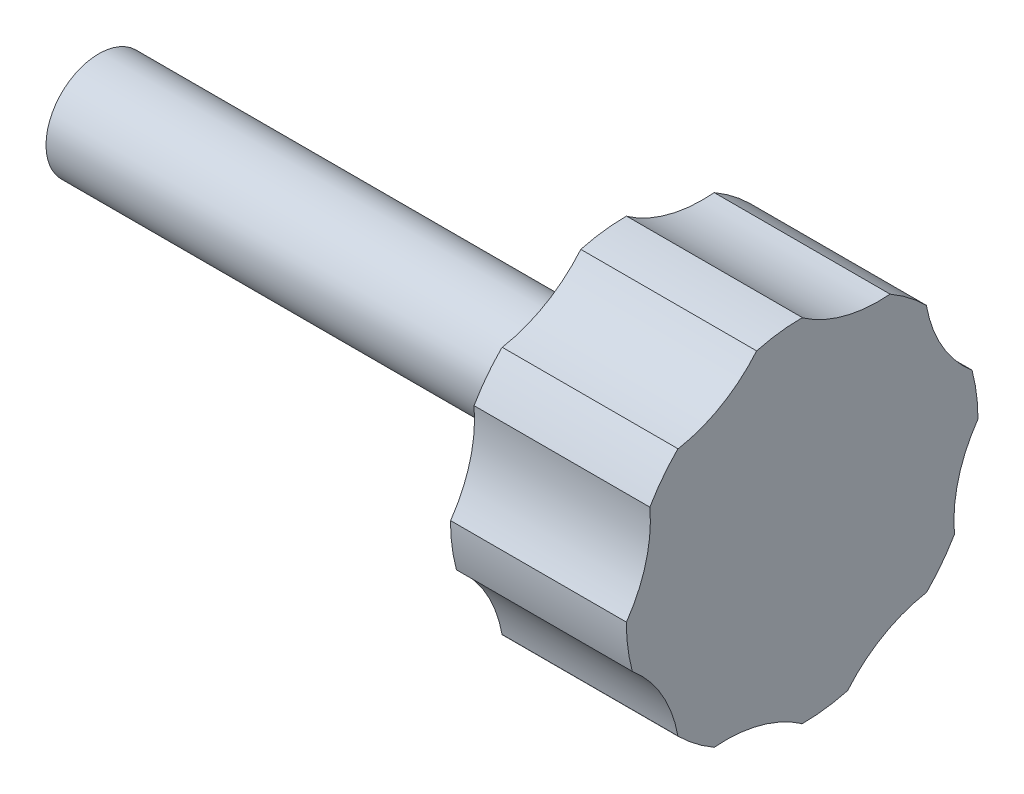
from build123d import *

# Parameters (mm, degrees)
ENL_V_MAT_EXTRU_9_DEPTH      = 10
R_P_TITION_CIRCULAIRE1_COUNT = 8


with BuildPart() as part:
    # Esquisse1 → R_volution1 (revolve)
    with BuildSketch(Plane.XY, mode=Mode.PRIVATE) as r_volution1_sk:
        Polygon((0, 0), (-40, 0), (-40, 3), (-10, 3), (-10, 10), (0, 10), align=None)
    revolve(r_volution1_sk.sketch.rotate(Axis((0, 0, 0), (1, 0, 0)), 90), axis=Axis((0, 0, 0), (1, 0, 0)))

    # Esquisse2 → Enl_v. mat.-Extru.9 (cut)
    with BuildSketch(Plane(origin=(-10, 0, 0), x_dir=(0, 0, -1), z_dir=(1, 0, 0))):
        with BuildLine():
            ThreePointArc((0, 9.992602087), (2.382597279, 8.885842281), (5, 8.660254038))
            ThreePointArc((5, 8.660254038), (2.813446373, 10.502721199), (0, 9.992602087))
        make_face()
    enl_v_mat_extru_9 = extrude(amount=ENL_V_MAT_EXTRU_9_DEPTH, mode=Mode.SUBTRACT)

    # R_p_tition circulaire1: Enl_v. mat.-Extru.9 ×8 about axis
    r_p_tition_circulaire1_axis = Axis((0, 0, 0), (1, 0, 0))
    for i in range(1, R_P_TITION_CIRCULAIRE1_COUNT):
        add(enl_v_mat_extru_9.rotate(r_p_tition_circulaire1_axis, i * 360 / R_P_TITION_CIRCULAIRE1_COUNT), mode=Mode.SUBTRACT)


solid = part.part
